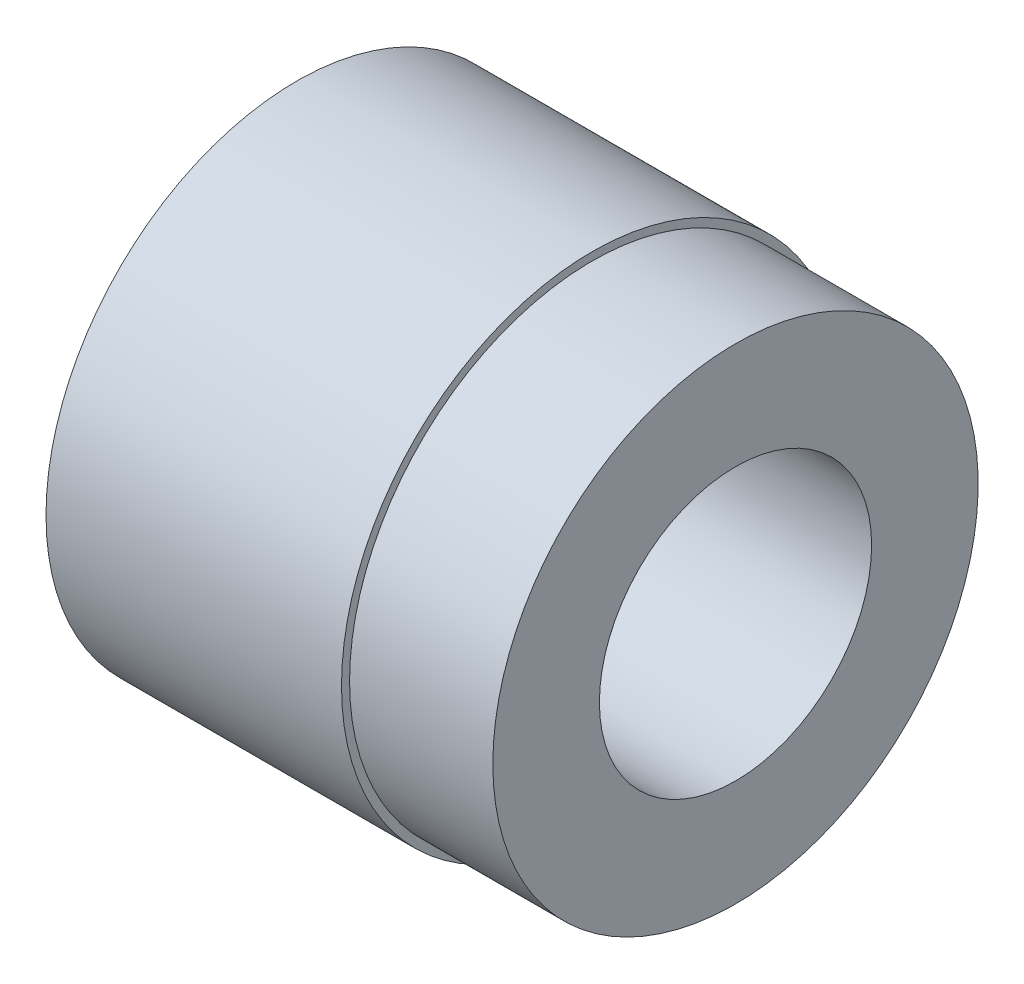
ISO-10303-21;
HEADER;
FILE_DESCRIPTION(('STEP AP214'),'2;1');
FILE_NAME('part.step','',(''),(''),'','','');
FILE_SCHEMA(('AUTOMOTIVE_DESIGN { 1 0 10303 214 1 1 1 1 }'));
ENDSEC;
DATA;
#1=APPLICATION_CONTEXT('core data for automotive mechanical design processes');
#2=APPLICATION_PROTOCOL_DEFINITION('international standard','automotive_design',2000,#1);
#3=PRODUCT_CONTEXT('',#1,'mechanical');
#4=PRODUCT('Part','Part','',(#3));
#5=PRODUCT_RELATED_PRODUCT_CATEGORY('part','',(#4));
#6=PRODUCT_DEFINITION_FORMATION('','',#4);
#7=PRODUCT_DEFINITION_CONTEXT('part definition',#1,'design');
#8=PRODUCT_DEFINITION('design','',#6,#7);
#9=PRODUCT_DEFINITION_SHAPE('','',#8);
#10=(LENGTH_UNIT() NAMED_UNIT(*) SI_UNIT(.MILLI.,.METRE.));
#11=(NAMED_UNIT(*) PLANE_ANGLE_UNIT() SI_UNIT($,.RADIAN.));
#12=(NAMED_UNIT(*) SI_UNIT($,.STERADIAN.) SOLID_ANGLE_UNIT());
#13=UNCERTAINTY_MEASURE_WITH_UNIT(LENGTH_MEASURE(1.E-05),#10,'distance_accuracy_value','');
#14=(GEOMETRIC_REPRESENTATION_CONTEXT(3) GLOBAL_UNCERTAINTY_ASSIGNED_CONTEXT((#13)) GLOBAL_UNIT_ASSIGNED_CONTEXT((#10,
#11,#12)) REPRESENTATION_CONTEXT('',''));
#15=CARTESIAN_POINT('',(0.,0.,0.));
#16=DIRECTION('',(0.,0.,1.));
#17=DIRECTION('',(1.,0.,0.));
#18=AXIS2_PLACEMENT_3D('',#15,#16,#17);
#19=CARTESIAN_POINT('',(-87.3124011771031,0.,0.));
#20=DIRECTION('',(-1.,0.,0.));
#21=DIRECTION('',(0.,0.,1.));
#22=AXIS2_PLACEMENT_3D('',#19,#20,#21);
#23=CYLINDRICAL_SURFACE('',#22,38.);
#24=CARTESIAN_POINT('',(43.604039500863,0.,0.));
#25=DIRECTION('',(-1.,0.,0.));
#26=DIRECTION('',(0.,0.,1.));
#27=AXIS2_PLACEMENT_3D('',#24,#25,#26);
#28=CIRCLE('',#27,38.);
#29=CARTESIAN_POINT('',(43.604039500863,0.,38.));
#30=VERTEX_POINT('',#29);
#31=EDGE_CURVE('E10',#30,#30,#28,.T.);
#32=ORIENTED_EDGE('',*,*,#31,.F.);
#33=EDGE_LOOP('',(#32));
#34=FACE_BOUND('',#33,.T.);
#35=CARTESIAN_POINT('',(-78.895960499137,0.,0.));
#36=DIRECTION('',(-1.,0.,0.));
#37=DIRECTION('',(0.,0.,1.));
#38=AXIS2_PLACEMENT_3D('',#35,#36,#37);
#39=CIRCLE('',#38,38.);
#40=CARTESIAN_POINT('',(-78.895960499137,0.,38.));
#41=VERTEX_POINT('',#40);
#42=EDGE_CURVE('E53',#41,#41,#39,.T.);
#43=ORIENTED_EDGE('',*,*,#42,.T.);
#44=EDGE_LOOP('',(#43));
#45=FACE_BOUND('',#44,.T.);
#46=ADVANCED_FACE('F31',(#34,#45),#23,.F.);
#47=CARTESIAN_POINT('',(43.604039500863,38.,0.));
#48=DIRECTION('',(-1.,0.,0.));
#49=DIRECTION('',(0.,0.,1.));
#50=AXIS2_PLACEMENT_3D('',#47,#48,#49);
#51=PLANE('',#50);
#52=CARTESIAN_POINT('',(43.604039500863,0.,0.));
#53=DIRECTION('',(-1.,0.,0.));
#54=DIRECTION('',(0.,0.,1.));
#55=AXIS2_PLACEMENT_3D('',#52,#53,#54);
#56=CIRCLE('',#55,67.75);
#57=CARTESIAN_POINT('',(43.604039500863,0.,67.75));
#58=VERTEX_POINT('',#57);
#59=EDGE_CURVE('E37',#58,#58,#56,.T.);
#60=ORIENTED_EDGE('',*,*,#59,.F.);
#61=EDGE_LOOP('',(#60));
#62=FACE_BOUND('',#61,.T.);
#63=ORIENTED_EDGE('',*,*,#31,.T.);
#64=EDGE_LOOP('',(#63));
#65=FACE_BOUND('',#64,.T.);
#66=ADVANCED_FACE('F78',(#62,#65),#51,.F.);
#67=CARTESIAN_POINT('',(-87.3124011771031,0.,0.));
#68=DIRECTION('',(-1.,0.,0.));
#69=DIRECTION('',(0.,0.,1.));
#70=AXIS2_PLACEMENT_3D('',#67,#68,#69);
#71=CYLINDRICAL_SURFACE('',#70,67.75);
#72=CARTESIAN_POINT('',(3.60403950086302,0.,0.));
#73=DIRECTION('',(-1.,0.,0.));
#74=DIRECTION('',(0.,0.,1.));
#75=AXIS2_PLACEMENT_3D('',#72,#73,#74);
#76=CIRCLE('',#75,67.75);
#77=CARTESIAN_POINT('',(3.60403950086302,0.,67.75));
#78=VERTEX_POINT('',#77);
#79=EDGE_CURVE('E41',#78,#78,#76,.T.);
#80=ORIENTED_EDGE('',*,*,#79,.F.);
#81=EDGE_LOOP('',(#80));
#82=FACE_BOUND('',#81,.T.);
#83=ORIENTED_EDGE('',*,*,#59,.T.);
#84=EDGE_LOOP('',(#83));
#85=FACE_BOUND('',#84,.T.);
#86=ADVANCED_FACE('F73',(#82,#85),#71,.T.);
#87=CARTESIAN_POINT('',(3.60403950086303,67.75,0.));
#88=DIRECTION('',(-1.,0.,0.));
#89=DIRECTION('',(0.,0.,1.));
#90=AXIS2_PLACEMENT_3D('',#87,#88,#89);
#91=PLANE('',#90);
#92=CARTESIAN_POINT('',(3.60403950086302,0.,0.));
#93=DIRECTION('',(-1.,0.,0.));
#94=DIRECTION('',(0.,0.,1.));
#95=AXIS2_PLACEMENT_3D('',#92,#93,#94);
#96=CIRCLE('',#95,70.);
#97=CARTESIAN_POINT('',(3.60403950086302,0.,70.));
#98=VERTEX_POINT('',#97);
#99=EDGE_CURVE('E45',#98,#98,#96,.T.);
#100=ORIENTED_EDGE('',*,*,#99,.F.);
#101=EDGE_LOOP('',(#100));
#102=FACE_BOUND('',#101,.T.);
#103=ORIENTED_EDGE('',*,*,#79,.T.);
#104=EDGE_LOOP('',(#103));
#105=FACE_BOUND('',#104,.T.);
#106=ADVANCED_FACE('F67',(#102,#105),#91,.F.);
#107=CARTESIAN_POINT('',(-87.3124011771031,0.,0.));
#108=DIRECTION('',(-1.,0.,0.));
#109=DIRECTION('',(0.,0.,1.));
#110=AXIS2_PLACEMENT_3D('',#107,#108,#109);
#111=CYLINDRICAL_SURFACE('',#110,70.);
#112=CARTESIAN_POINT('',(-78.895960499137,0.,0.));
#113=DIRECTION('',(-1.,0.,0.));
#114=DIRECTION('',(0.,0.,1.));
#115=AXIS2_PLACEMENT_3D('',#112,#113,#114);
#116=CIRCLE('',#115,70.);
#117=CARTESIAN_POINT('',(-78.895960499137,0.,70.));
#118=VERTEX_POINT('',#117);
#119=EDGE_CURVE('E50',#118,#118,#116,.T.);
#120=ORIENTED_EDGE('',*,*,#119,.F.);
#121=EDGE_LOOP('',(#120));
#122=FACE_BOUND('',#121,.T.);
#123=ORIENTED_EDGE('',*,*,#99,.T.);
#124=EDGE_LOOP('',(#123));
#125=FACE_BOUND('',#124,.T.);
#126=ADVANCED_FACE('F61',(#122,#125),#111,.T.);
#127=CARTESIAN_POINT('',(-78.895960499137,70.,0.));
#128=DIRECTION('',(1.,0.,0.));
#129=DIRECTION('',(0.,0.,-1.));
#130=AXIS2_PLACEMENT_3D('',#127,#128,#129);
#131=PLANE('',#130);
#132=ORIENTED_EDGE('',*,*,#42,.F.);
#133=EDGE_LOOP('',(#132));
#134=FACE_BOUND('',#133,.T.);
#135=ORIENTED_EDGE('',*,*,#119,.T.);
#136=EDGE_LOOP('',(#135));
#137=FACE_BOUND('',#136,.T.);
#138=ADVANCED_FACE('F58',(#134,#137),#131,.F.);
#139=CLOSED_SHELL('',(#46,#66,#86,#106,#126,#138));
#140=MANIFOLD_SOLID_BREP('B2',#139);
#141=ADVANCED_BREP_SHAPE_REPRESENTATION('',(#18,#140),#14);
#142=SHAPE_DEFINITION_REPRESENTATION(#9,#141);
ENDSEC;
END-ISO-10303-21;
